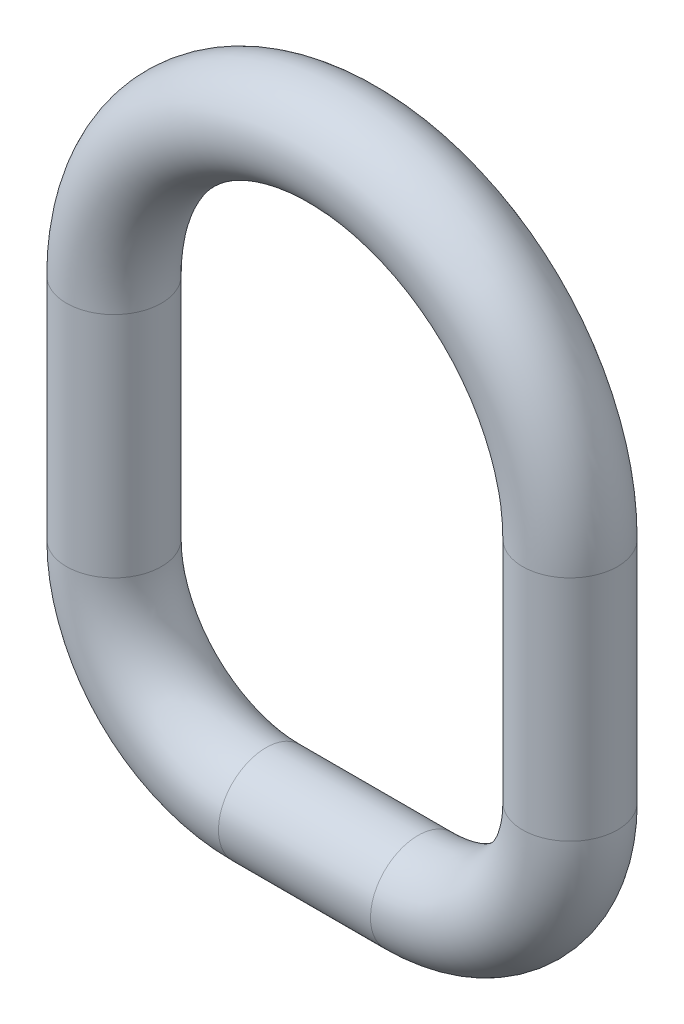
ISO-10303-21;
HEADER;
FILE_DESCRIPTION(('STEP AP214'),'2;1');
FILE_NAME('part.step','',(''),(''),'','','');
FILE_SCHEMA(('AUTOMOTIVE_DESIGN { 1 0 10303 214 1 1 1 1 }'));
ENDSEC;
DATA;
#1=APPLICATION_CONTEXT('core data for automotive mechanical design processes');
#2=APPLICATION_PROTOCOL_DEFINITION('international standard','automotive_design',2000,#1);
#3=PRODUCT_CONTEXT('',#1,'mechanical');
#4=PRODUCT('Part','Part','',(#3));
#5=PRODUCT_RELATED_PRODUCT_CATEGORY('part','',(#4));
#6=PRODUCT_DEFINITION_FORMATION('','',#4);
#7=PRODUCT_DEFINITION_CONTEXT('part definition',#1,'design');
#8=PRODUCT_DEFINITION('design','',#6,#7);
#9=PRODUCT_DEFINITION_SHAPE('','',#8);
#10=(LENGTH_UNIT() NAMED_UNIT(*) SI_UNIT(.MILLI.,.METRE.));
#11=(NAMED_UNIT(*) PLANE_ANGLE_UNIT() SI_UNIT($,.RADIAN.));
#12=(NAMED_UNIT(*) SI_UNIT($,.STERADIAN.) SOLID_ANGLE_UNIT());
#13=UNCERTAINTY_MEASURE_WITH_UNIT(LENGTH_MEASURE(1.E-05),#10,'distance_accuracy_value','');
#14=(GEOMETRIC_REPRESENTATION_CONTEXT(3) GLOBAL_UNCERTAINTY_ASSIGNED_CONTEXT((#13)) GLOBAL_UNIT_ASSIGNED_CONTEXT((#10,
#11,#12)) REPRESENTATION_CONTEXT('',''));
#15=CARTESIAN_POINT('',(0.,0.,0.));
#16=DIRECTION('',(0.,0.,1.));
#17=DIRECTION('',(1.,0.,0.));
#18=AXIS2_PLACEMENT_3D('',#15,#16,#17);
#19=CARTESIAN_POINT('',(6.35,12.7,0.));
#20=DIRECTION('',(0.,0.,-1.));
#21=DIRECTION('',(-1.,0.,0.));
#22=AXIS2_PLACEMENT_3D('',#19,#20,#21);
#23=TOROIDAL_SURFACE('',#22,12.7,3.96875);
#24=CARTESIAN_POINT('',(19.05,12.7,0.));
#25=DIRECTION('',(0.,1.,0.));
#26=DIRECTION('',(0.,0.,-1.));
#27=AXIS2_PLACEMENT_3D('',#24,#25,#26);
#28=CIRCLE('',#27,3.96875);
#29=CARTESIAN_POINT('',(23.01875,12.7,0.));
#30=VERTEX_POINT('',#29);
#31=EDGE_CURVE('E36',#30,#30,#28,.T.);
#32=CARTESIAN_POINT('',(6.35,0.,0.));
#33=DIRECTION('',(1.,0.,0.));
#34=DIRECTION('',(0.,0.,-1.));
#35=AXIS2_PLACEMENT_3D('',#32,#33,#34);
#36=CIRCLE('',#35,3.96875);
#37=CARTESIAN_POINT('',(6.35,-3.96875,0.));
#38=VERTEX_POINT('',#37);
#39=EDGE_CURVE('E10',#38,#38,#36,.T.);
#40=CARTESIAN_POINT('',(6.35,12.7,0.));
#41=DIRECTION('',(0.,0.,-1.));
#42=DIRECTION('',(-1.,0.,0.));
#43=AXIS2_PLACEMENT_3D('',#40,#41,#42);
#44=CIRCLE('',#43,16.66875);
#45=EDGE_CURVE('',#30,#38,#44,.T.);
#46=ORIENTED_EDGE('',*,*,#31,.F.);
#47=ORIENTED_EDGE('',*,*,#39,.T.);
#48=ORIENTED_EDGE('',*,*,#45,.T.);
#49=ORIENTED_EDGE('',*,*,#45,.F.);
#50=EDGE_LOOP('',(#46,#48,#47,#49));
#51=FACE_BOUND('',#50,.T.);
#52=ADVANCED_FACE('F30',(#51),#23,.T.);
#53=CARTESIAN_POINT('',(19.05,31.75,0.));
#54=DIRECTION('',(0.,-1.,0.));
#55=DIRECTION('',(0.,0.,-1.));
#56=AXIS2_PLACEMENT_3D('',#53,#54,#55);
#57=CYLINDRICAL_SURFACE('',#56,3.96875);
#58=CARTESIAN_POINT('',(19.05,31.75,0.));
#59=DIRECTION('',(0.,1.,0.));
#60=DIRECTION('',(0.,0.,-1.));
#61=AXIS2_PLACEMENT_3D('',#58,#59,#60);
#62=CIRCLE('',#61,3.96875);
#63=CARTESIAN_POINT('',(23.01875,31.75,0.));
#64=VERTEX_POINT('',#63);
#65=EDGE_CURVE('E40',#64,#64,#62,.T.);
#66=ORIENTED_EDGE('',*,*,#65,.F.);
#67=EDGE_LOOP('',(#66));
#68=FACE_BOUND('',#67,.T.);
#69=ORIENTED_EDGE('',*,*,#31,.T.);
#70=EDGE_LOOP('',(#69));
#71=FACE_BOUND('',#70,.T.);
#72=ADVANCED_FACE('F74',(#68,#71),#57,.T.);
#73=CARTESIAN_POINT('',(0.,31.75,0.));
#74=DIRECTION('',(0.,0.,-1.));
#75=DIRECTION('',(-1.,0.,0.));
#76=AXIS2_PLACEMENT_3D('',#73,#74,#75);
#77=TOROIDAL_SURFACE('',#76,19.05,3.96875);
#78=CARTESIAN_POINT('',(-19.05,31.75,0.));
#79=DIRECTION('',(0.,-1.,0.));
#80=DIRECTION('',(0.,0.,-1.));
#81=AXIS2_PLACEMENT_3D('',#78,#79,#80);
#82=CIRCLE('',#81,3.96875);
#83=CARTESIAN_POINT('',(-23.01875,31.75,0.));
#84=VERTEX_POINT('',#83);
#85=EDGE_CURVE('E44',#84,#84,#82,.T.);
#86=CARTESIAN_POINT('',(0.,31.75,0.));
#87=DIRECTION('',(0.,0.,-1.));
#88=DIRECTION('',(-1.,0.,0.));
#89=AXIS2_PLACEMENT_3D('',#86,#87,#88);
#90=CIRCLE('',#89,23.01875);
#91=EDGE_CURVE('',#84,#64,#90,.T.);
#92=ORIENTED_EDGE('',*,*,#85,.F.);
#93=ORIENTED_EDGE('',*,*,#65,.T.);
#94=ORIENTED_EDGE('',*,*,#91,.T.);
#95=ORIENTED_EDGE('',*,*,#91,.F.);
#96=EDGE_LOOP('',(#92,#94,#93,#95));
#97=FACE_BOUND('',#96,.T.);
#98=ADVANCED_FACE('F68',(#97),#77,.T.);
#99=CARTESIAN_POINT('',(-19.05,12.7,0.));
#100=DIRECTION('',(0.,1.,0.));
#101=DIRECTION('',(-1.,0.,0.));
#102=AXIS2_PLACEMENT_3D('',#99,#100,#101);
#103=CYLINDRICAL_SURFACE('',#102,3.96875);
#104=CARTESIAN_POINT('',(-19.05,12.7,0.));
#105=DIRECTION('',(0.,-1.,0.));
#106=DIRECTION('',(0.,0.,-1.));
#107=AXIS2_PLACEMENT_3D('',#104,#105,#106);
#108=CIRCLE('',#107,3.96875);
#109=CARTESIAN_POINT('',(-23.01875,12.7,0.));
#110=VERTEX_POINT('',#109);
#111=EDGE_CURVE('E49',#110,#110,#108,.T.);
#112=ORIENTED_EDGE('',*,*,#111,.F.);
#113=EDGE_LOOP('',(#112));
#114=FACE_BOUND('',#113,.T.);
#115=ORIENTED_EDGE('',*,*,#85,.T.);
#116=EDGE_LOOP('',(#115));
#117=FACE_BOUND('',#116,.T.);
#118=ADVANCED_FACE('F62',(#114,#117),#103,.T.);
#119=CARTESIAN_POINT('',(-6.35,12.7,0.));
#120=DIRECTION('',(0.,0.,-1.));
#121=DIRECTION('',(-1.,0.,0.));
#122=AXIS2_PLACEMENT_3D('',#119,#120,#121);
#123=TOROIDAL_SURFACE('',#122,12.7,3.96875);
#124=CARTESIAN_POINT('',(-6.35,0.,0.));
#125=DIRECTION('',(1.,0.,0.));
#126=DIRECTION('',(0.,0.,-1.));
#127=AXIS2_PLACEMENT_3D('',#124,#125,#126);
#128=CIRCLE('',#127,3.96875);
#129=CARTESIAN_POINT('',(-6.35,-3.96875,0.));
#130=VERTEX_POINT('',#129);
#131=EDGE_CURVE('E52',#130,#130,#128,.T.);
#132=CARTESIAN_POINT('',(-6.35,12.7,0.));
#133=DIRECTION('',(0.,0.,-1.));
#134=DIRECTION('',(-1.,0.,0.));
#135=AXIS2_PLACEMENT_3D('',#132,#133,#134);
#136=CIRCLE('',#135,16.66875);
#137=EDGE_CURVE('',#130,#110,#136,.T.);
#138=ORIENTED_EDGE('',*,*,#131,.F.);
#139=ORIENTED_EDGE('',*,*,#111,.T.);
#140=ORIENTED_EDGE('',*,*,#137,.T.);
#141=ORIENTED_EDGE('',*,*,#137,.F.);
#142=EDGE_LOOP('',(#138,#140,#139,#141));
#143=FACE_BOUND('',#142,.T.);
#144=ADVANCED_FACE('F59',(#143),#123,.T.);
#145=CARTESIAN_POINT('',(-6.35,0.,0.));
#146=DIRECTION('',(1.,0.,0.));
#147=DIRECTION('',(0.,1.,0.));
#148=AXIS2_PLACEMENT_3D('',#145,#146,#147);
#149=CYLINDRICAL_SURFACE('',#148,3.96875);
#150=ORIENTED_EDGE('',*,*,#131,.T.);
#151=EDGE_LOOP('',(#150));
#152=FACE_BOUND('',#151,.T.);
#153=ORIENTED_EDGE('',*,*,#39,.F.);
#154=EDGE_LOOP('',(#153));
#155=FACE_BOUND('',#154,.T.);
#156=ADVANCED_FACE('F56',(#152,#155),#149,.T.);
#157=CLOSED_SHELL('',(#52,#72,#98,#118,#144,#156));
#158=MANIFOLD_SOLID_BREP('B2',#157);
#159=ADVANCED_BREP_SHAPE_REPRESENTATION('',(#18,#158),#14);
#160=SHAPE_DEFINITION_REPRESENTATION(#9,#159);
ENDSEC;
END-ISO-10303-21;
